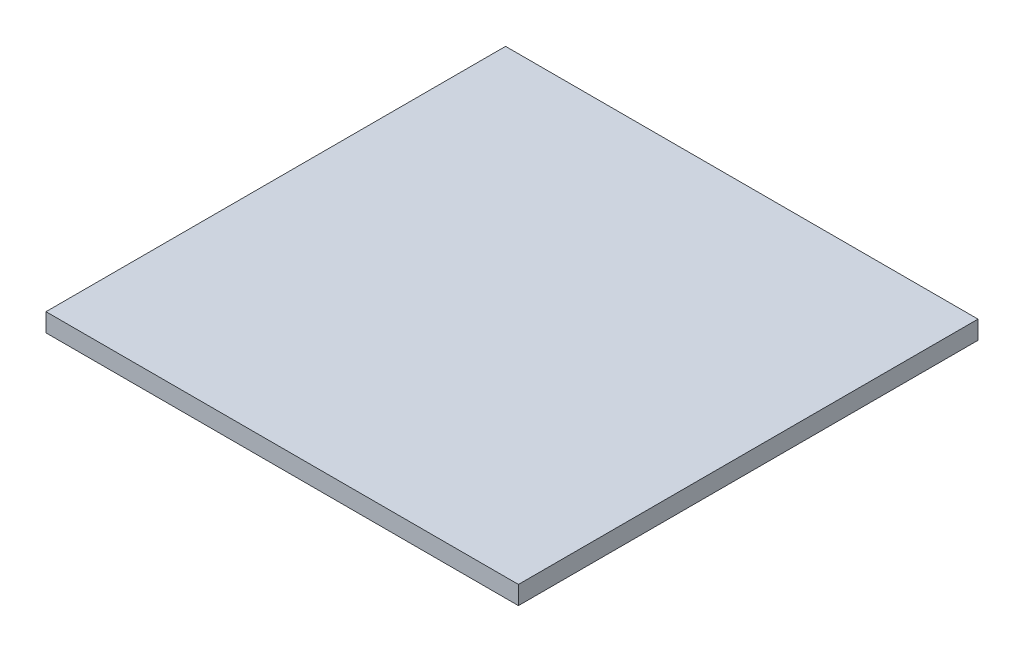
from build123d import *

# Parameters (mm, degrees)
SKETCH1_W           = 25.7
SKETCH1_H           = 25
BOSS_EXTRUDE1_DEPTH = 1


with BuildPart() as part:
    # Sketch1 → Boss-Extrude1 (new body)
    with BuildSketch(Plane(origin=(0, 0, 0), x_dir=(1, 0, 0), z_dir=(0, 1, 0))):
        with Locations((-0.122358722, -3.41031941)):
            Rectangle(SKETCH1_W, SKETCH1_H)
    extrude(amount=BOSS_EXTRUDE1_DEPTH)


solid = part.part
